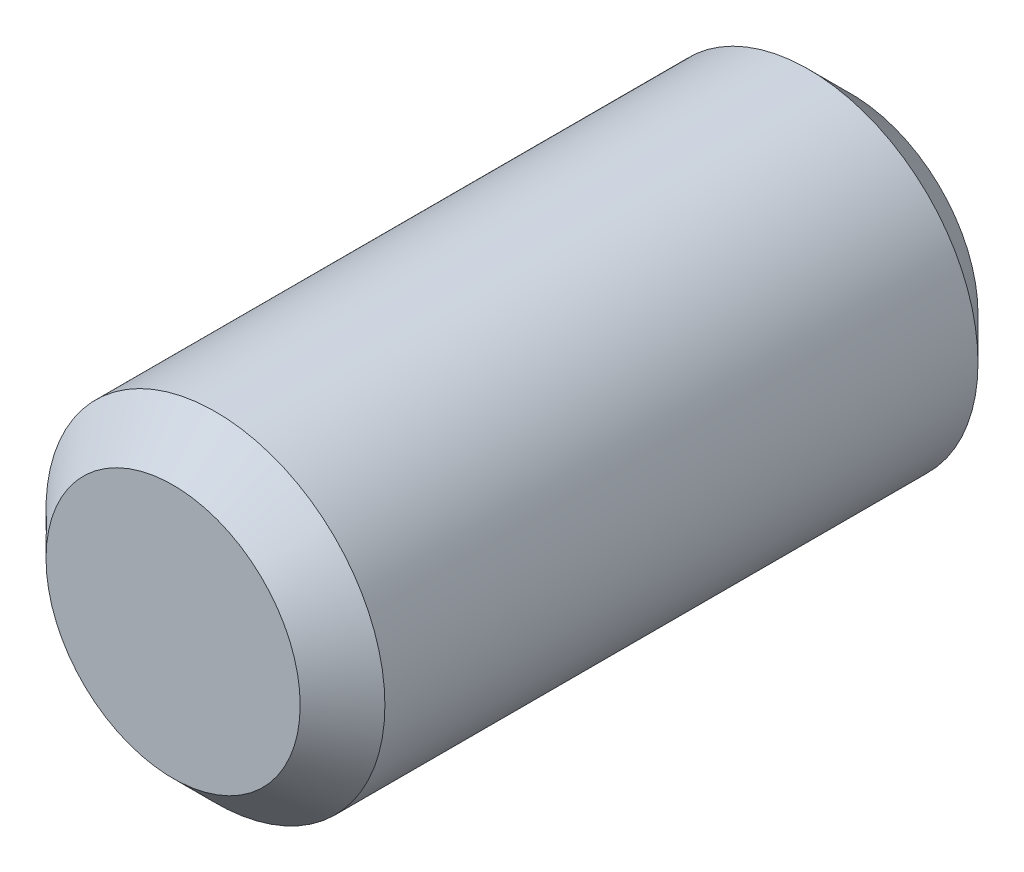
from build123d import *

# Parameters (mm, degrees)
ESQUISSE1_R             = 2
BOSS_EXTRU_1_DEPTH      = 8
CHANFREIN1_SIZE         = 0.5
ENL_V_MAT_EXTRU_1_DEPTH = 2


with BuildPart() as part:
    # Esquisse1 → Boss.-Extru.1 (new body)
    with BuildSketch(Plane.XY):
        Circle(ESQUISSE1_R)
    extrude(amount=BOSS_EXTRU_1_DEPTH)

    # Chanfrein1
    chanfrein1_edges = [part.edges().sort_by_distance(p)[0] for p in [
        (-2, 0, 0),
        (-2, 0, 8),
    ]]
    chamfer(chanfrein1_edges, length=CHANFREIN1_SIZE)

    # Esquisse2 → Enl_v. mat.-Extru.1 (cut)
    with BuildSketch(Plane(origin=(0, 0, 0), x_dir=(-1, 0, 0), z_dir=(0, 0, -1))):
        Polygon((1.154700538, 0), (0.577350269, 1), (-0.577350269, 1), (-1.154700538, 0), (-0.577350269, -1), (0.577350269, -1), align=None)
    extrude(amount=-ENL_V_MAT_EXTRU_1_DEPTH, mode=Mode.SUBTRACT)


solid = part.part
